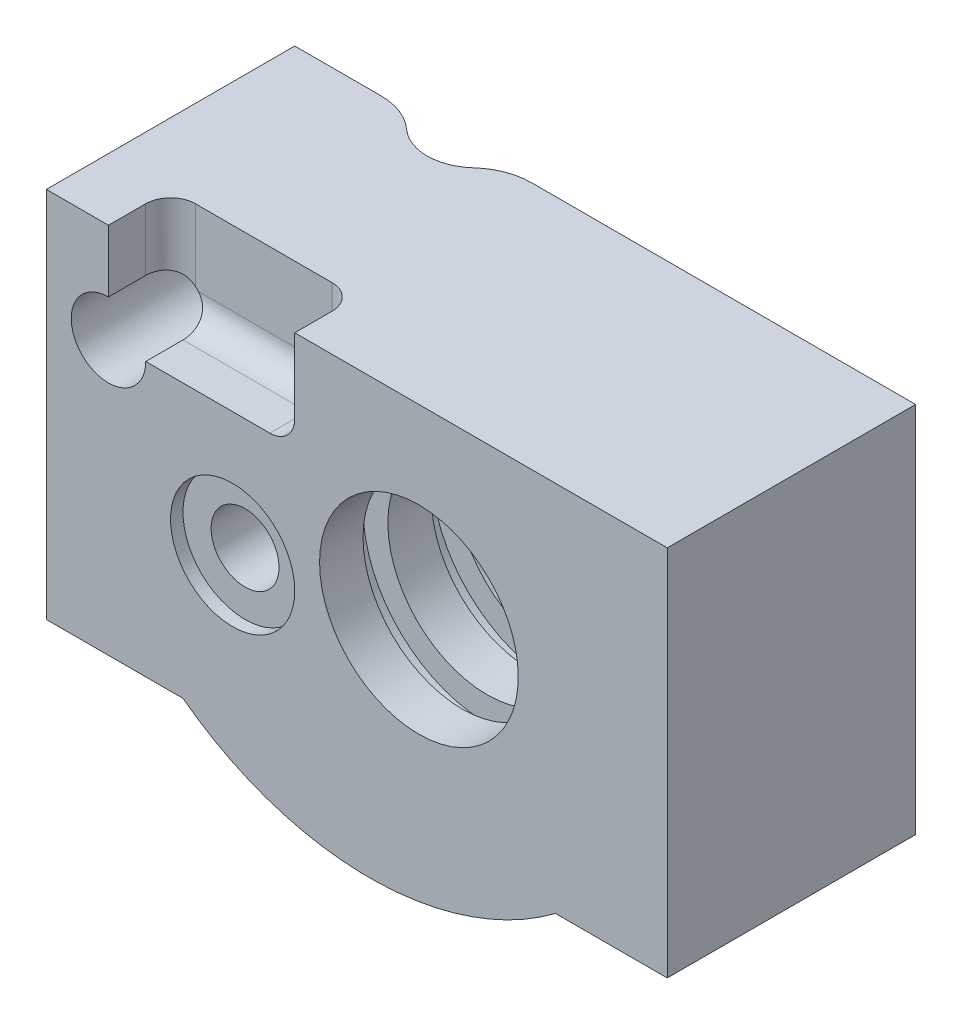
from build123d import *

# Parameters (mm, degrees)
EXTRUDE_1_DEPTH                  = 20
SKETCH_8_R                       = 4
CUT_EXTRUDE_3_DEPTH              = 51.249378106
FILLET_2_R                       = 5
EXTRUDE_2_REACH                  = 43.231
EXTRUDE_2_END_RADIUS             = 10
SKETCH_4_W                       = 1
SKETCH_4_H                       = 1.37957238
EXTRUDE_2_DIRECTION_2_REACH      = 43.231
EXTRUDE_2_DIRECTION_2_END_RADIUS = 10
SKETCH_5_W                       = 15
SKETCH_5_H                       = 8
CUT_EXTRUDE_1_DEPTH              = 5
FILLET_1_R                       = 2
SKETCH_6_R                       = 3
CUT_EXTRUDE_2_DEPTH              = 42.231056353
SKETCH_9_R                       = 2.734702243
CUT_EXTRUDE_4_DEPTH              = 42.231056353
SKETCH_12_R                      = 0.75
FILLET_6_R                       = 0.5
PATTERN_CIRCULAR_1_COUNT         = 3


with BuildPart() as part:
    # Sketch 2 → Extrude 1 (new body)
    with BuildSketch(Plane.XY):
        with BuildLine():
            Line((-30, 15), (20, 15))
            Line((20, 15), (20, -15))
            Line((20, -15), (11, -15))
            ThreePointArc((11, -15), (-4, -20), (-19, -15))
            Line((-19, -15), (-30, -15))
            Line((-30, -15), (-30, 15))
        make_face()
    extrude(amount=EXTRUDE_1_DEPTH)

    # Sketch 8 → Cut-Extrude 3 (cut, through all)
    with BuildSketch(Plane(origin=(0, 15, 0), x_dir=(1, 0, 0), z_dir=(0, 1, 0))):
        with Locations((-17, 1.660325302)):
            Circle(SKETCH_8_R)
    extrude(amount=-CUT_EXTRUDE_3_DEPTH, mode=Mode.SUBTRACT)

    # Fillet 2
    fillet_2_edges = [part.edges().sort_by_distance(p)[0] for p in [
        (-20.639137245, 0, 0),
        (-13.360862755, -1.590667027, 0),
    ]]
    fillet(fillet_2_edges, radius=FILLET_2_R)

    # Sketch 3 → Cut-Revolve 1 (revolve, cut)
    with BuildSketch(Plane(origin=(0, 0, 0), x_dir=(1, 0, 0), z_dir=(0, 1, 0))):
        Polygon((0, 0), (-8, 0), (-8, -3.5), (-10, -3.5), (-10, -5.5), (-8, -5.5), (-8, -9), (-10, -9), (-10, -11), (-8, -11), (-8, -14.5), (-10, -14.5), (-10, -16.5), (-8, -16.5), (-8, -20), (0, -20), align=None)
    revolve(axis=Axis((0, 0, 0), (0, 0, 1)), mode=Mode.SUBTRACT)

    # Extrude 2: up to this cylinder (the profile starts inside it)
    extrude_2_end = Plane(origin=(0, 0, 15.5), z_dir=(0, 0, -1)) * Cylinder(EXTRUDE_2_END_RADIUS, 107.462, mode=Mode.PRIVATE)
    # Sketch 4 → Extrude 2 (add, up to the surface)
    with BuildSketch(Plane(origin=(0, 0, 0), x_dir=(0, 0, -1), z_dir=(1, 0, 0)), mode=Mode.PRIVATE) as extrude_2_sk1:
        with Locations((-15.5, 9.99745912)):
            Rectangle(SKETCH_4_W, SKETCH_4_H)
    extrude_2_tool1 = extrude(extrude_2_sk1.sketch, amount=EXTRUDE_2_REACH, mode=Mode.PRIVATE) & extrude_2_end
    add(extrude_2_tool1.solids().sort_by_distance((0, 9.997459, 15.5))[0])

    # Extrude 2 direction 2: up to this cylinder (the profile starts inside it)
    extrude_2_direction_2_end = Plane(origin=(0, 0, 15.5), z_dir=(0, 0, -1)) * Cylinder(EXTRUDE_2_DIRECTION_2_END_RADIUS, 107.462, mode=Mode.PRIVATE)
    # Sketch 4 → Extrude 2 direction 2 (add, up to the surface)
    with BuildSketch(Plane(origin=(0, 0, 0), x_dir=(0, 0, -1), z_dir=(1, 0, 0)), mode=Mode.PRIVATE) as extrude_2_direction_2_sk1:
        with Locations((-15.5, 9.99745912)):
            Rectangle(SKETCH_4_W, SKETCH_4_H)
    extrude_2_direction_2_tool1 = extrude(extrude_2_direction_2_sk1.sketch, amount=-EXTRUDE_2_DIRECTION_2_REACH, mode=Mode.PRIVATE) & extrude_2_direction_2_end
    add(extrude_2_direction_2_tool1.solids().sort_by_distance((0, 9.997459, 15.5))[0])

    # Sketch 5 → Cut-Extrude 1 (cut)
    with BuildSketch(Plane.XY.offset(20)):
        with Locations((-17.5, 11)):
            Rectangle(SKETCH_5_W, SKETCH_5_H)
    extrude(amount=-CUT_EXTRUDE_1_DEPTH, mode=Mode.SUBTRACT)

    # Fillet 1
    fillet_1_edges = [part.edges().sort_by_distance(p)[0] for p in [
        (-25, 11, 15),
        (-25, 7, 17.5),
        (-10, 11, 15),
        (-17.5, 7, 15),
        (-10, 7, 17.5),
    ]]
    fillet(fillet_1_edges, radius=FILLET_1_R)

    # Sketch 6 → Cut-Extrude 2 (cut, through all)
    with BuildSketch(Plane.XY.offset(20)):
        with Locations((-25, 7)):
            Circle(SKETCH_6_R)
    extrude(amount=-CUT_EXTRUDE_2_DEPTH, mode=Mode.SUBTRACT)

    # Sketch 9 → Cut-Extrude 4 (cut, through all)
    with BuildSketch(Plane.XY.offset(20)):
        with Locations((-15, -3)):
            Circle(SKETCH_9_R)
    extrude(amount=-CUT_EXTRUDE_4_DEPTH, mode=Mode.SUBTRACT)

    # Sketch 10 → Cut-Revolve 4 (revolve, cut)
    with BuildSketch(Plane(origin=(-15, 0, 0), x_dir=(0, 0, -1), z_dir=(1, 0, 0)), mode=Mode.PRIVATE) as cut_revolve_4_sk:
        Polygon((-19, -5), (0, -5), (0, -3), (-20, -3), (-20, -8), (-19, -8), align=None)
    revolve(cut_revolve_4_sk.sketch.rotate(Axis((-15, -3, 20), (0, 0, -1)), 345.379782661), axis=Axis((-15, -3, 20), (0, 0, -1)), mode=Mode.SUBTRACT)


with BuildPart() as body_2:
    # Sweep 1: sweep along a path in Sketch 11
    with BuildLine(Plane(origin=(-15, 0, 0), x_dir=(0, 0, -1), z_dir=(1, 0, 0))) as sweep_1_path:
        Line((-17, 1), (-16, 1))
        ThreePointArc((-16, 1), (-14.585786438, 0.414213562), (-14, -1))
        Line((-14, -1), (-14, -5))
        ThreePointArc((-14, -5), (-14.585786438, -6.414213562), (-16, -7))
        Line((-16, -7), (-17, -7))
    # Sketch 12 → Sweep 1 (sweep)
    with BuildSketch(Plane(origin=(-15, 1, 17), x_dir=(-1, 0, 0), z_dir=(0, 0, -1))):
        with Locations((0.001816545, 0.017168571)):
            Circle(SKETCH_12_R)
    sweep(path=sweep_1_path.line)

    # Fillet 6
    fillet_6_edges = [body_2.edges().sort_by_distance(p)[0] for p in [
        (-14.251816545, 1.017168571, 17),
        (-14.251816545, -7.017168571, 17),
    ]]
    fillet(fillet_6_edges, radius=FILLET_6_R)


with BuildPart() as body_3:
    # Mirror 1: mirrored copy
    add(body_2.part.mirror(Plane.XY.offset(13)))


with BuildPart() as pattern_circular_1_1:
    # Pattern Circular 1: pattern copy
    add(body_3.part.rotate(Axis((-15, -3, 0), (0, 0, 1)), 1 * 360 / PATTERN_CIRCULAR_1_COUNT))


with BuildPart() as pattern_circular_1_2:
    # Pattern Circular 1: pattern copy
    add(body_3.part.rotate(Axis((-15, -3, 0), (0, 0, 1)), 2 * 360 / PATTERN_CIRCULAR_1_COUNT))


with BuildPart() as pattern_circular_1_3:
    # Pattern Circular 1: pattern copy
    add(body_2.part.rotate(Axis((-15, -3, 0), (0, 0, 1)), 1 * 360 / PATTERN_CIRCULAR_1_COUNT))


with BuildPart() as pattern_circular_1_4:
    # Pattern Circular 1: pattern copy
    add(body_2.part.rotate(Axis((-15, -3, 0), (0, 0, 1)), 2 * 360 / PATTERN_CIRCULAR_1_COUNT))


with BuildPart() as part_1:
    add(part.part)

    # Combine 1: cut body 2, Pattern Circular 1_4, Pattern Circular 1_3, Pattern Circular 1_1, body 3, Pattern Circular 1_2
    add(body_2.part, mode=Mode.SUBTRACT)
    add(pattern_circular_1_4.part, mode=Mode.SUBTRACT)
    add(pattern_circular_1_3.part, mode=Mode.SUBTRACT)
    add(pattern_circular_1_1.part, mode=Mode.SUBTRACT)
    add(body_3.part, mode=Mode.SUBTRACT)
    add(pattern_circular_1_2.part, mode=Mode.SUBTRACT)


solid = part_1.part
